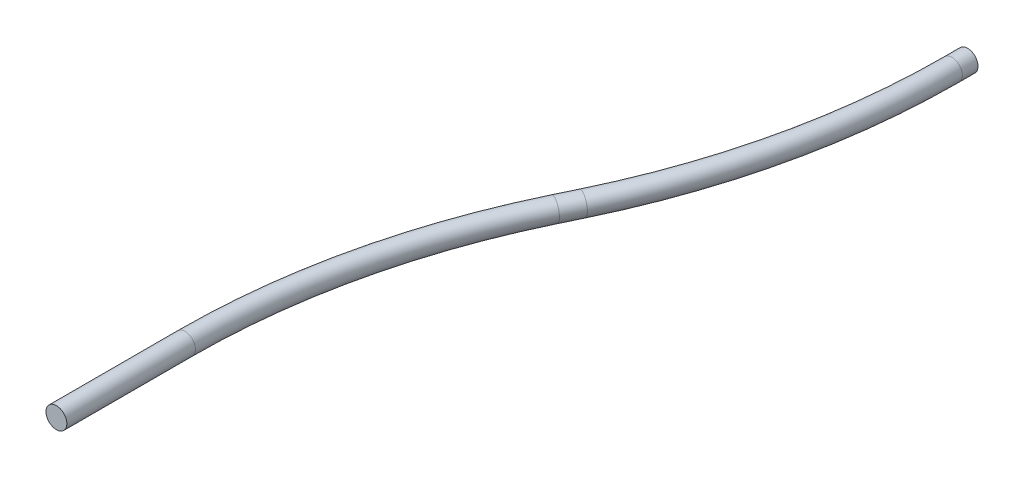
from build123d import *

# Parameters (mm, degrees)
CIRCLE_R = 1.524


with BuildPart() as part:
    # Sweep1: sweep along a path in Sketch2
    with BuildLine(Plane(origin=(0, 0, 0), x_dir=(1, 0, 0), z_dir=(0, 1, 0))) as sweep1_path:
        Line((0, 0), (0, 18.788809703))
        ThreePointArc((0, 18.788809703), (2.532886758, 41.333589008), (10.005257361, 62.754286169))
        Line((10.005257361, 62.754286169), (11.330742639, 65.515713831))
        ThreePointArc((11.330742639, 65.515713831), (18.803113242, 86.936410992), (21.336, 109.481190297))
        Line((21.336, 109.481190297), (21.336, 111.76))
    # circle → Sweep1 (sweep)
    with BuildSketch(Plane.XY):
        Circle(CIRCLE_R)
    sweep(path=sweep1_path.line)


solid = part.part
